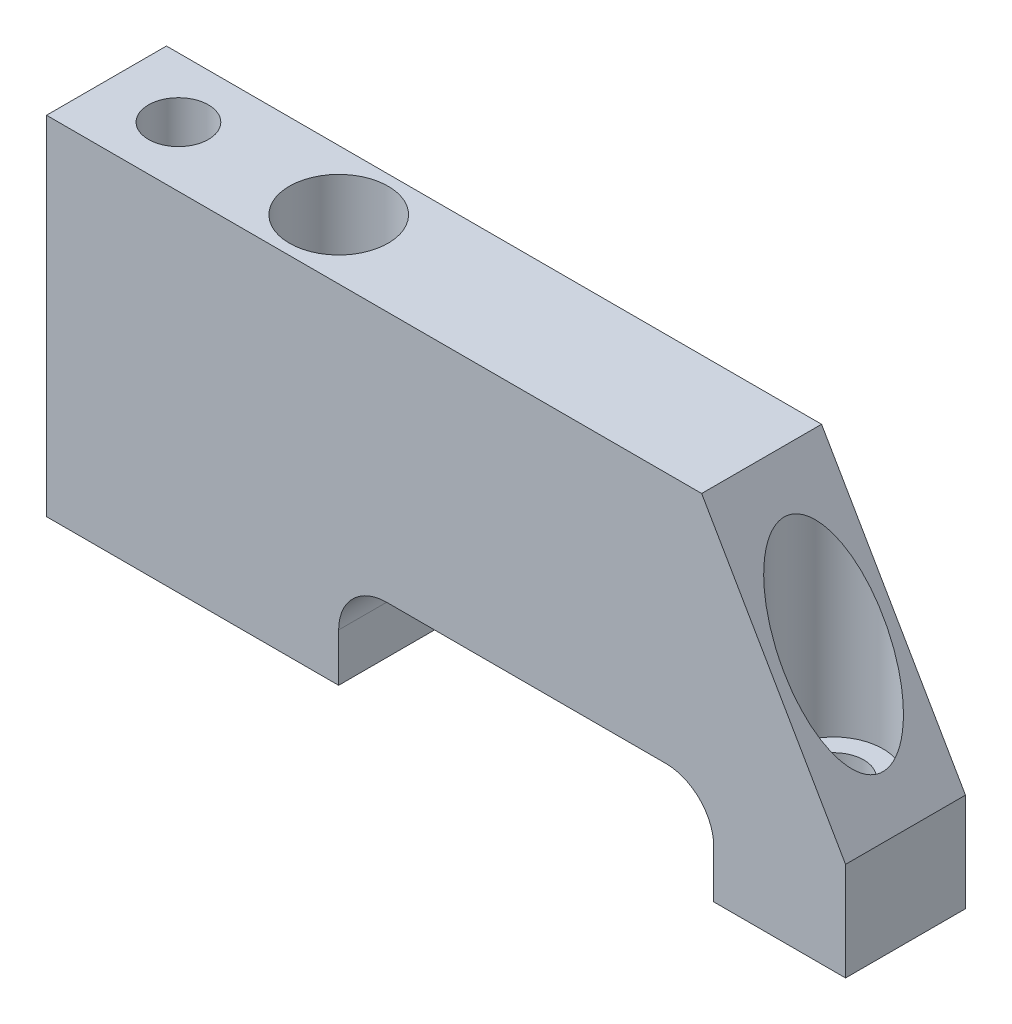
ISO-10303-21;
HEADER;
FILE_DESCRIPTION(('STEP AP214'),'2;1');
FILE_NAME('part.step','',(''),(''),'','','');
FILE_SCHEMA(('AUTOMOTIVE_DESIGN { 1 0 10303 214 1 1 1 1 }'));
ENDSEC;
DATA;
#1=APPLICATION_CONTEXT('core data for automotive mechanical design processes');
#2=APPLICATION_PROTOCOL_DEFINITION('international standard','automotive_design',2000,#1);
#3=PRODUCT_CONTEXT('',#1,'mechanical');
#4=PRODUCT('Part','Part','',(#3));
#5=PRODUCT_RELATED_PRODUCT_CATEGORY('part','',(#4));
#6=PRODUCT_DEFINITION_FORMATION('','',#4);
#7=PRODUCT_DEFINITION_CONTEXT('part definition',#1,'design');
#8=PRODUCT_DEFINITION('design','',#6,#7);
#9=PRODUCT_DEFINITION_SHAPE('','',#8);
#10=(LENGTH_UNIT() NAMED_UNIT(*) SI_UNIT(.MILLI.,.METRE.));
#11=(NAMED_UNIT(*) PLANE_ANGLE_UNIT() SI_UNIT($,.RADIAN.));
#12=(NAMED_UNIT(*) SI_UNIT($,.STERADIAN.) SOLID_ANGLE_UNIT());
#13=UNCERTAINTY_MEASURE_WITH_UNIT(LENGTH_MEASURE(1.E-05),#10,'distance_accuracy_value','');
#14=(GEOMETRIC_REPRESENTATION_CONTEXT(3) GLOBAL_UNCERTAINTY_ASSIGNED_CONTEXT((#13)) GLOBAL_UNIT_ASSIGNED_CONTEXT((#10,
#11,#12)) REPRESENTATION_CONTEXT('',''));
#15=CARTESIAN_POINT('',(0.,0.,0.));
#16=DIRECTION('',(0.,0.,1.));
#17=DIRECTION('',(1.,0.,0.));
#18=AXIS2_PLACEMENT_3D('',#15,#16,#17);
#19=CARTESIAN_POINT('',(42.2783,0.,7.9375));
#20=DIRECTION('',(-1.,0.,0.));
#21=DIRECTION('',(0.,0.,1.));
#22=AXIS2_PLACEMENT_3D('',#19,#20,#21);
#23=PLANE('',#22);
#24=DIRECTION('',(0.,0.,-1.));
#25=VECTOR('',#24,1.);
#26=CARTESIAN_POINT('',(42.2783,13.0292321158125,155.477634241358));
#27=LINE('',#26,#25);
#28=CARTESIAN_POINT('',(42.2783,13.0292321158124,7.9375));
#29=VERTEX_POINT('',#28);
#30=CARTESIAN_POINT('',(42.2783,13.0292321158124,-7.9375));
#31=VERTEX_POINT('',#30);
#32=EDGE_CURVE('E70',#29,#31,#27,.T.);
#33=ORIENTED_EDGE('',*,*,#32,.F.);
#34=DIRECTION('',(0.,1.,0.));
#35=VECTOR('',#34,1.);
#36=CARTESIAN_POINT('',(42.2783,0.,7.9375));
#37=LINE('',#36,#35);
#38=CARTESIAN_POINT('',(42.2783,0.,7.9375));
#39=VERTEX_POINT('',#38);
#40=EDGE_CURVE('E201',#39,#29,#37,.T.);
#41=ORIENTED_EDGE('',*,*,#40,.F.);
#42=DIRECTION('',(0.,0.,-1.));
#43=VECTOR('',#42,1.);
#44=CARTESIAN_POINT('',(42.2783,0.,7.9375));
#45=LINE('',#44,#43);
#46=CARTESIAN_POINT('',(42.2783,0.,-7.9375));
#47=VERTEX_POINT('',#46);
#48=EDGE_CURVE('E220',#39,#47,#45,.T.);
#49=ORIENTED_EDGE('',*,*,#48,.T.);
#50=DIRECTION('',(0.,1.,0.));
#51=VECTOR('',#50,1.);
#52=CARTESIAN_POINT('',(42.2783,0.,-7.9375));
#53=LINE('',#52,#51);
#54=EDGE_CURVE('E146',#47,#31,#53,.T.);
#55=ORIENTED_EDGE('',*,*,#54,.T.);
#56=EDGE_LOOP('',(#33,#41,#49,#55));
#57=FACE_BOUND('',#56,.T.);
#58=ADVANCED_FACE('F47',(#57),#23,.F.);
#59=CARTESIAN_POINT('',(42.2783,46.0248,7.9375));
#60=DIRECTION('',(0.,-1.,0.));
#61=DIRECTION('',(1.,0.,0.));
#62=AXIS2_PLACEMENT_3D('',#59,#60,#61);
#63=PLANE('',#62);
#64=CARTESIAN_POINT('',(-32.7533,46.0248,0.));
#65=DIRECTION('',(0.,1.,0.));
#66=DIRECTION('',(0.,0.,1.));
#67=AXIS2_PLACEMENT_3D('',#64,#65,#66);
#68=CIRCLE('',#67,6.5405);
#69=CARTESIAN_POINT('',(-32.7533,46.0248,6.5405));
#70=VERTEX_POINT('',#69);
#71=EDGE_CURVE('E175',#70,#70,#68,.T.);
#72=ORIENTED_EDGE('',*,*,#71,.F.);
#73=EDGE_LOOP('',(#72));
#74=FACE_BOUND('',#73,.T.);
#75=CARTESIAN_POINT('',(-53.975,46.0248,0.));
#76=DIRECTION('',(0.,1.,0.));
#77=DIRECTION('',(0.,0.,1.));
#78=AXIS2_PLACEMENT_3D('',#75,#76,#77);
#79=CIRCLE('',#78,3.96874999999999);
#80=CARTESIAN_POINT('',(-53.975,46.0248,3.96874999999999));
#81=VERTEX_POINT('',#80);
#82=EDGE_CURVE('E157',#81,#81,#79,.T.);
#83=ORIENTED_EDGE('',*,*,#82,.F.);
#84=EDGE_LOOP('',(#83));
#85=FACE_BOUND('',#84,.T.);
#86=DIRECTION('',(0.,0.,-1.));
#87=VECTOR('',#86,1.);
#88=CARTESIAN_POINT('',(23.2283,46.0248,155.477634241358));
#89=LINE('',#88,#87);
#90=CARTESIAN_POINT('',(23.2283,46.0248,7.9375));
#91=VERTEX_POINT('',#90);
#92=CARTESIAN_POINT('',(23.2283,46.0248,-7.93749999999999));
#93=VERTEX_POINT('',#92);
#94=EDGE_CURVE('E149',#91,#93,#89,.T.);
#95=ORIENTED_EDGE('',*,*,#94,.T.);
#96=DIRECTION('',(-1.,0.,0.));
#97=VECTOR('',#96,1.);
#98=CARTESIAN_POINT('',(42.2783,46.0248,-7.9375));
#99=LINE('',#98,#97);
#100=CARTESIAN_POINT('',(-63.5,46.0248,-7.9375));
#101=VERTEX_POINT('',#100);
#102=EDGE_CURVE('E134',#93,#101,#99,.T.);
#103=ORIENTED_EDGE('',*,*,#102,.T.);
#104=DIRECTION('',(0.,0.,-1.));
#105=VECTOR('',#104,1.);
#106=CARTESIAN_POINT('',(-63.5,46.0248,7.9375));
#107=LINE('',#106,#105);
#108=CARTESIAN_POINT('',(-63.5,46.0248,7.9375));
#109=VERTEX_POINT('',#108);
#110=EDGE_CURVE('E204',#109,#101,#107,.T.);
#111=ORIENTED_EDGE('',*,*,#110,.F.);
#112=DIRECTION('',(-1.,0.,0.));
#113=VECTOR('',#112,1.);
#114=CARTESIAN_POINT('',(42.2783,46.0248,7.9375));
#115=LINE('',#114,#113);
#116=EDGE_CURVE('E151',#91,#109,#115,.T.);
#117=ORIENTED_EDGE('',*,*,#116,.F.);
#118=EDGE_LOOP('',(#95,#103,#111,#117));
#119=FACE_BOUND('',#118,.T.);
#120=ADVANCED_FACE('F150',(#74,#85,#119),#63,.F.);
#121=CARTESIAN_POINT('',(0.,0.,7.9375));
#122=DIRECTION('',(0.,0.,1.));
#123=DIRECTION('',(1.,0.,0.));
#124=AXIS2_PLACEMENT_3D('',#121,#122,#123);
#125=PLANE('',#124);
#126=ORIENTED_EDGE('',*,*,#40,.T.);
#127=DIRECTION('',(-0.499999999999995,0.866025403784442,0.));
#128=VECTOR('',#127,1.);
#129=CARTESIAN_POINT('',(37.350548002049,21.5643489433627,7.9375));
#130=LINE('',#129,#128);
#131=EDGE_CURVE('E62',#29,#91,#130,.T.);
#132=ORIENTED_EDGE('',*,*,#131,.T.);
#133=ORIENTED_EDGE('',*,*,#116,.T.);
#134=DIRECTION('',(0.,-1.,0.));
#135=VECTOR('',#134,1.);
#136=CARTESIAN_POINT('',(-63.5,46.0248,7.9375));
#137=LINE('',#136,#135);
#138=CARTESIAN_POINT('',(-63.5,0.,7.9375));
#139=VERTEX_POINT('',#138);
#140=EDGE_CURVE('E145',#109,#139,#137,.T.);
#141=ORIENTED_EDGE('',*,*,#140,.T.);
#142=DIRECTION('',(1.,0.,0.));
#143=VECTOR('',#142,1.);
#144=CARTESIAN_POINT('',(-63.5,0.,7.9375));
#145=LINE('',#144,#143);
#146=CARTESIAN_POINT('',(-24.8285,0.,7.9375));
#147=VERTEX_POINT('',#146);
#148=EDGE_CURVE('E189',#139,#147,#145,.T.);
#149=ORIENTED_EDGE('',*,*,#148,.T.);
#150=DIRECTION('',(0.,1.,0.));
#151=VECTOR('',#150,1.);
#152=CARTESIAN_POINT('',(-24.8285,0.,7.9375));
#153=LINE('',#152,#151);
#154=CARTESIAN_POINT('',(-24.8285,6.35,7.9375));
#155=VERTEX_POINT('',#154);
#156=EDGE_CURVE('E191',#147,#155,#153,.T.);
#157=ORIENTED_EDGE('',*,*,#156,.T.);
#158=CARTESIAN_POINT('',(-18.4785,6.35,7.9375));
#159=DIRECTION('',(0.,0.,1.));
#160=DIRECTION('',(1.,0.,0.));
#161=AXIS2_PLACEMENT_3D('',#158,#159,#160);
#162=CIRCLE('',#161,6.35);
#163=CARTESIAN_POINT('',(-18.4785,12.7,7.9375));
#164=VERTEX_POINT('',#163);
#165=EDGE_CURVE('E55',#155,#164,#162,.F.);
#166=ORIENTED_EDGE('',*,*,#165,.T.);
#167=DIRECTION('',(1.,0.,0.));
#168=VECTOR('',#167,1.);
#169=CARTESIAN_POINT('',(-24.8285,12.7,7.9375));
#170=LINE('',#169,#168);
#171=CARTESIAN_POINT('',(18.4785,12.7,7.9375));
#172=VERTEX_POINT('',#171);
#173=EDGE_CURVE('E194',#164,#172,#170,.T.);
#174=ORIENTED_EDGE('',*,*,#173,.T.);
#175=CARTESIAN_POINT('',(18.4785,6.35,7.9375));
#176=DIRECTION('',(0.,0.,1.));
#177=DIRECTION('',(1.,0.,0.));
#178=AXIS2_PLACEMENT_3D('',#175,#176,#177);
#179=CIRCLE('',#178,6.35);
#180=CARTESIAN_POINT('',(24.8285,6.35,7.9375));
#181=VERTEX_POINT('',#180);
#182=EDGE_CURVE('E244',#172,#181,#179,.F.);
#183=ORIENTED_EDGE('',*,*,#182,.T.);
#184=DIRECTION('',(0.,-1.,0.));
#185=VECTOR('',#184,1.);
#186=CARTESIAN_POINT('',(24.8285,12.7,7.9375));
#187=LINE('',#186,#185);
#188=CARTESIAN_POINT('',(24.8285,0.,7.9375));
#189=VERTEX_POINT('',#188);
#190=EDGE_CURVE('E197',#181,#189,#187,.T.);
#191=ORIENTED_EDGE('',*,*,#190,.T.);
#192=DIRECTION('',(1.,0.,0.));
#193=VECTOR('',#192,1.);
#194=CARTESIAN_POINT('',(24.8285,0.,7.9375));
#195=LINE('',#194,#193);
#196=EDGE_CURVE('E199',#189,#39,#195,.T.);
#197=ORIENTED_EDGE('',*,*,#196,.T.);
#198=EDGE_LOOP('',(#126,#132,#133,#141,#149,#157,#166,#174,#183,#191,#197));
#199=FACE_BOUND('',#198,.T.);
#200=ADVANCED_FACE('F249',(#199),#125,.T.);
#201=CARTESIAN_POINT('',(0.,0.,-7.9375));
#202=DIRECTION('',(0.,0.,1.));
#203=DIRECTION('',(1.,0.,0.));
#204=AXIS2_PLACEMENT_3D('',#201,#202,#203);
#205=PLANE('',#204);
#206=DIRECTION('',(-0.499999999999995,0.866025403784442,0.));
#207=VECTOR('',#206,1.);
#208=CARTESIAN_POINT('',(37.350548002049,21.5643489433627,-7.9375));
#209=LINE('',#208,#207);
#210=EDGE_CURVE('E139',#31,#93,#209,.T.);
#211=ORIENTED_EDGE('',*,*,#210,.F.);
#212=ORIENTED_EDGE('',*,*,#54,.F.);
#213=DIRECTION('',(1.,0.,0.));
#214=VECTOR('',#213,1.);
#215=CARTESIAN_POINT('',(24.8285,0.,-7.9375));
#216=LINE('',#215,#214);
#217=CARTESIAN_POINT('',(24.8285,0.,-7.9375));
#218=VERTEX_POINT('',#217);
#219=EDGE_CURVE('E216',#218,#47,#216,.T.);
#220=ORIENTED_EDGE('',*,*,#219,.F.);
#221=DIRECTION('',(0.,-1.,0.));
#222=VECTOR('',#221,1.);
#223=CARTESIAN_POINT('',(24.8285,12.7,-7.9375));
#224=LINE('',#223,#222);
#225=CARTESIAN_POINT('',(24.8285,6.35,-7.9375));
#226=VERTEX_POINT('',#225);
#227=EDGE_CURVE('E214',#226,#218,#224,.T.);
#228=ORIENTED_EDGE('',*,*,#227,.F.);
#229=CARTESIAN_POINT('',(18.4785,6.35,-7.9375));
#230=DIRECTION('',(0.,0.,1.));
#231=DIRECTION('',(1.,0.,0.));
#232=AXIS2_PLACEMENT_3D('',#229,#230,#231);
#233=CIRCLE('',#232,6.35);
#234=CARTESIAN_POINT('',(18.4785,12.7,-7.9375));
#235=VERTEX_POINT('',#234);
#236=EDGE_CURVE('E242',#226,#235,#233,.T.);
#237=ORIENTED_EDGE('',*,*,#236,.T.);
#238=DIRECTION('',(1.,0.,0.));
#239=VECTOR('',#238,1.);
#240=CARTESIAN_POINT('',(-24.8285,12.7,-7.9375));
#241=LINE('',#240,#239);
#242=CARTESIAN_POINT('',(-18.4785,12.7,-7.9375));
#243=VERTEX_POINT('',#242);
#244=EDGE_CURVE('E211',#243,#235,#241,.T.);
#245=ORIENTED_EDGE('',*,*,#244,.F.);
#246=CARTESIAN_POINT('',(-18.4785,6.35,-7.9375));
#247=DIRECTION('',(0.,0.,1.));
#248=DIRECTION('',(1.,0.,0.));
#249=AXIS2_PLACEMENT_3D('',#246,#247,#248);
#250=CIRCLE('',#249,6.35);
#251=CARTESIAN_POINT('',(-24.8285,6.35,-7.9375));
#252=VERTEX_POINT('',#251);
#253=EDGE_CURVE('E246',#243,#252,#250,.T.);
#254=ORIENTED_EDGE('',*,*,#253,.T.);
#255=DIRECTION('',(0.,1.,0.));
#256=VECTOR('',#255,1.);
#257=CARTESIAN_POINT('',(-24.8285,0.,-7.9375));
#258=LINE('',#257,#256);
#259=CARTESIAN_POINT('',(-24.8285,0.,-7.9375));
#260=VERTEX_POINT('',#259);
#261=EDGE_CURVE('E208',#260,#252,#258,.T.);
#262=ORIENTED_EDGE('',*,*,#261,.F.);
#263=DIRECTION('',(1.,0.,0.));
#264=VECTOR('',#263,1.);
#265=CARTESIAN_POINT('',(-63.5,0.,-7.9375));
#266=LINE('',#265,#264);
#267=CARTESIAN_POINT('',(-63.5,0.,-7.9375));
#268=VERTEX_POINT('',#267);
#269=EDGE_CURVE('E206',#268,#260,#266,.T.);
#270=ORIENTED_EDGE('',*,*,#269,.F.);
#271=DIRECTION('',(0.,-1.,0.));
#272=VECTOR('',#271,1.);
#273=CARTESIAN_POINT('',(-63.5,46.0248,-7.9375));
#274=LINE('',#273,#272);
#275=EDGE_CURVE('E141',#101,#268,#274,.T.);
#276=ORIENTED_EDGE('',*,*,#275,.F.);
#277=ORIENTED_EDGE('',*,*,#102,.F.);
#278=EDGE_LOOP('',(#211,#212,#220,#228,#237,#245,#254,#262,#270,#276,#277));
#279=FACE_BOUND('',#278,.T.);
#280=ADVANCED_FACE('F136',(#279),#205,.F.);
#281=CARTESIAN_POINT('',(32.7533,46.0248,0.));
#282=DIRECTION('',(0.,1.,0.));
#283=DIRECTION('',(0.,0.,1.));
#284=AXIS2_PLACEMENT_3D('',#281,#282,#283);
#285=CYLINDRICAL_SURFACE('',#284,6.54049999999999);
#286=CARTESIAN_POINT('',(32.7533,14.2748,0.));
#287=DIRECTION('',(0.,1.,0.));
#288=DIRECTION('',(0.,0.,1.));
#289=AXIS2_PLACEMENT_3D('',#286,#287,#288);
#290=CIRCLE('',#289,6.54049999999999);
#291=CARTESIAN_POINT('',(32.7533,14.2748,6.54049999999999));
#292=VERTEX_POINT('',#291);
#293=EDGE_CURVE('E166',#292,#292,#290,.T.);
#294=ORIENTED_EDGE('',*,*,#293,.F.);
#295=EDGE_LOOP('',(#294));
#296=FACE_BOUND('',#295,.T.);
#297=CARTESIAN_POINT('',(32.7533,29.5270160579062,0.));
#298=DIRECTION('',(0.866025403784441,0.499999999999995,0.));
#299=DIRECTION('',(-0.499999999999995,0.866025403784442,0.));
#300=AXIS2_PLACEMENT_3D('',#297,#298,#299);
#301=ELLIPSE('',#300,13.0810000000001,6.54049999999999);
#302=CARTESIAN_POINT('',(26.2128,40.8554943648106,0.));
#303=VERTEX_POINT('',#302);
#304=EDGE_CURVE('E13',#303,#303,#301,.F.);
#305=ORIENTED_EDGE('',*,*,#304,.F.);
#306=EDGE_LOOP('',(#305));
#307=FACE_BOUND('',#306,.T.);
#308=ADVANCED_FACE('F270',(#296,#307),#285,.F.);
#309=CARTESIAN_POINT('',(-63.5,46.0248,7.9375));
#310=DIRECTION('',(1.,0.,0.));
#311=DIRECTION('',(0.,1.,0.));
#312=AXIS2_PLACEMENT_3D('',#309,#310,#311);
#313=PLANE('',#312);
#314=ORIENTED_EDGE('',*,*,#275,.T.);
#315=DIRECTION('',(0.,0.,-1.));
#316=VECTOR('',#315,1.);
#317=CARTESIAN_POINT('',(-63.5,0.,7.9375));
#318=LINE('',#317,#316);
#319=EDGE_CURVE('E229',#139,#268,#318,.T.);
#320=ORIENTED_EDGE('',*,*,#319,.F.);
#321=ORIENTED_EDGE('',*,*,#140,.F.);
#322=ORIENTED_EDGE('',*,*,#110,.T.);
#323=EDGE_LOOP('',(#314,#320,#321,#322));
#324=FACE_BOUND('',#323,.T.);
#325=ADVANCED_FACE('F268',(#324),#313,.F.);
#326=CARTESIAN_POINT('',(-63.5,0.,7.9375));
#327=DIRECTION('',(0.,1.,0.));
#328=DIRECTION('',(0.,0.,1.));
#329=AXIS2_PLACEMENT_3D('',#326,#327,#328);
#330=PLANE('',#329);
#331=CARTESIAN_POINT('',(-32.7533,0.,0.));
#332=DIRECTION('',(0.,1.,0.));
#333=DIRECTION('',(0.,0.,1.));
#334=AXIS2_PLACEMENT_3D('',#331,#332,#333);
#335=CIRCLE('',#334,4.00049999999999);
#336=CARTESIAN_POINT('',(-32.7533,0.,4.00049999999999));
#337=VERTEX_POINT('',#336);
#338=EDGE_CURVE('E184',#337,#337,#335,.T.);
#339=ORIENTED_EDGE('',*,*,#338,.T.);
#340=EDGE_LOOP('',(#339));
#341=FACE_BOUND('',#340,.T.);
#342=ORIENTED_EDGE('',*,*,#269,.T.);
#343=DIRECTION('',(0.,0.,-1.));
#344=VECTOR('',#343,1.);
#345=CARTESIAN_POINT('',(-24.8285,0.,7.9375));
#346=LINE('',#345,#344);
#347=EDGE_CURVE('E226',#147,#260,#346,.T.);
#348=ORIENTED_EDGE('',*,*,#347,.F.);
#349=ORIENTED_EDGE('',*,*,#148,.F.);
#350=ORIENTED_EDGE('',*,*,#319,.T.);
#351=EDGE_LOOP('',(#342,#348,#349,#350));
#352=FACE_BOUND('',#351,.T.);
#353=ADVANCED_FACE('F264',(#341,#352),#330,.F.);
#354=CARTESIAN_POINT('',(-24.8285,0.,7.9375));
#355=DIRECTION('',(-1.,0.,0.));
#356=DIRECTION('',(0.,0.,1.));
#357=AXIS2_PLACEMENT_3D('',#354,#355,#356);
#358=PLANE('',#357);
#359=ORIENTED_EDGE('',*,*,#261,.T.);
#360=DIRECTION('',(0.,0.,-1.));
#361=VECTOR('',#360,1.);
#362=CARTESIAN_POINT('',(-24.8285,6.35,7.9375));
#363=LINE('',#362,#361);
#364=EDGE_CURVE('E240',#252,#155,#363,.F.);
#365=ORIENTED_EDGE('',*,*,#364,.T.);
#366=ORIENTED_EDGE('',*,*,#156,.F.);
#367=ORIENTED_EDGE('',*,*,#347,.T.);
#368=EDGE_LOOP('',(#359,#365,#366,#367));
#369=FACE_BOUND('',#368,.T.);
#370=ADVANCED_FACE('F261',(#369),#358,.F.);
#371=CARTESIAN_POINT('',(-24.8285,12.7,7.9375));
#372=DIRECTION('',(0.,1.,0.));
#373=DIRECTION('',(0.,0.,1.));
#374=AXIS2_PLACEMENT_3D('',#371,#372,#373);
#375=PLANE('',#374);
#376=ORIENTED_EDGE('',*,*,#244,.T.);
#377=DIRECTION('',(0.,0.,-1.));
#378=VECTOR('',#377,1.);
#379=CARTESIAN_POINT('',(18.4785,12.7,7.9375));
#380=LINE('',#379,#378);
#381=EDGE_CURVE('E238',#235,#172,#380,.F.);
#382=ORIENTED_EDGE('',*,*,#381,.T.);
#383=ORIENTED_EDGE('',*,*,#173,.F.);
#384=DIRECTION('',(0.,0.,-1.));
#385=VECTOR('',#384,1.);
#386=CARTESIAN_POINT('',(-18.4785,12.7,-7.9375));
#387=LINE('',#386,#385);
#388=EDGE_CURVE('E235',#164,#243,#387,.T.);
#389=ORIENTED_EDGE('',*,*,#388,.T.);
#390=EDGE_LOOP('',(#376,#382,#383,#389));
#391=FACE_BOUND('',#390,.T.);
#392=ADVANCED_FACE('F256',(#391),#375,.F.);
#393=CARTESIAN_POINT('',(24.8285,12.7,7.9375));
#394=DIRECTION('',(1.,0.,0.));
#395=DIRECTION('',(0.,0.,-1.));
#396=AXIS2_PLACEMENT_3D('',#393,#394,#395);
#397=PLANE('',#396);
#398=ORIENTED_EDGE('',*,*,#190,.F.);
#399=DIRECTION('',(0.,0.,-1.));
#400=VECTOR('',#399,1.);
#401=CARTESIAN_POINT('',(24.8285,6.35,-7.9375));
#402=LINE('',#401,#400);
#403=EDGE_CURVE('E232',#181,#226,#402,.T.);
#404=ORIENTED_EDGE('',*,*,#403,.T.);
#405=ORIENTED_EDGE('',*,*,#227,.T.);
#406=DIRECTION('',(0.,0.,-1.));
#407=VECTOR('',#406,1.);
#408=CARTESIAN_POINT('',(24.8285,0.,7.9375));
#409=LINE('',#408,#407);
#410=EDGE_CURVE('E223',#189,#218,#409,.T.);
#411=ORIENTED_EDGE('',*,*,#410,.F.);
#412=EDGE_LOOP('',(#398,#404,#405,#411));
#413=FACE_BOUND('',#412,.T.);
#414=ADVANCED_FACE('F293',(#413),#397,.F.);
#415=CARTESIAN_POINT('',(24.8285,0.,7.9375));
#416=DIRECTION('',(0.,1.,0.));
#417=DIRECTION('',(-1.,0.,0.));
#418=AXIS2_PLACEMENT_3D('',#415,#416,#417);
#419=PLANE('',#418);
#420=CARTESIAN_POINT('',(32.7533,0.,0.));
#421=DIRECTION('',(0.,1.,0.));
#422=DIRECTION('',(0.,0.,1.));
#423=AXIS2_PLACEMENT_3D('',#420,#421,#422);
#424=CIRCLE('',#423,4.00049999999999);
#425=CARTESIAN_POINT('',(32.7533,0.,4.00049999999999));
#426=VERTEX_POINT('',#425);
#427=EDGE_CURVE('E172',#426,#426,#424,.T.);
#428=ORIENTED_EDGE('',*,*,#427,.T.);
#429=EDGE_LOOP('',(#428));
#430=FACE_BOUND('',#429,.T.);
#431=ORIENTED_EDGE('',*,*,#219,.T.);
#432=ORIENTED_EDGE('',*,*,#48,.F.);
#433=ORIENTED_EDGE('',*,*,#196,.F.);
#434=ORIENTED_EDGE('',*,*,#410,.T.);
#435=EDGE_LOOP('',(#431,#432,#433,#434));
#436=FACE_BOUND('',#435,.T.);
#437=ADVANCED_FACE('F289',(#430,#436),#419,.F.);
#438=CARTESIAN_POINT('',(18.4785,6.35,7.9375));
#439=DIRECTION('',(0.,0.,1.));
#440=DIRECTION('',(1.,0.,0.));
#441=AXIS2_PLACEMENT_3D('',#438,#439,#440);
#442=CYLINDRICAL_SURFACE('',#441,6.35);
#443=ORIENTED_EDGE('',*,*,#182,.F.);
#444=ORIENTED_EDGE('',*,*,#381,.F.);
#445=ORIENTED_EDGE('',*,*,#236,.F.);
#446=ORIENTED_EDGE('',*,*,#403,.F.);
#447=EDGE_LOOP('',(#443,#444,#445,#446));
#448=FACE_BOUND('',#447,.T.);
#449=ADVANCED_FACE('F292',(#448),#442,.F.);
#450=CARTESIAN_POINT('',(-18.4785,6.35,7.9375));
#451=DIRECTION('',(0.,0.,1.));
#452=DIRECTION('',(1.,0.,0.));
#453=AXIS2_PLACEMENT_3D('',#450,#451,#452);
#454=CYLINDRICAL_SURFACE('',#453,6.35);
#455=ORIENTED_EDGE('',*,*,#165,.F.);
#456=ORIENTED_EDGE('',*,*,#364,.F.);
#457=ORIENTED_EDGE('',*,*,#253,.F.);
#458=ORIENTED_EDGE('',*,*,#388,.F.);
#459=EDGE_LOOP('',(#455,#456,#457,#458));
#460=FACE_BOUND('',#459,.T.);
#461=ADVANCED_FACE('F49',(#460),#454,.F.);
#462=CARTESIAN_POINT('',(-32.7533,46.0248,0.));
#463=DIRECTION('',(0.,1.,0.));
#464=DIRECTION('',(0.,0.,1.));
#465=AXIS2_PLACEMENT_3D('',#462,#463,#464);
#466=CYLINDRICAL_SURFACE('',#465,4.00049999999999);
#467=ORIENTED_EDGE('',*,*,#338,.F.);
#468=EDGE_LOOP('',(#467));
#469=FACE_BOUND('',#468,.T.);
#470=CARTESIAN_POINT('',(-32.7533,14.2748,0.));
#471=DIRECTION('',(0.,1.,0.));
#472=DIRECTION('',(0.,0.,1.));
#473=AXIS2_PLACEMENT_3D('',#470,#471,#472);
#474=CIRCLE('',#473,4.00049999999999);
#475=CARTESIAN_POINT('',(-32.7533,14.2748,4.00049999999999));
#476=VERTEX_POINT('',#475);
#477=EDGE_CURVE('E181',#476,#476,#474,.T.);
#478=ORIENTED_EDGE('',*,*,#477,.T.);
#479=EDGE_LOOP('',(#478));
#480=FACE_BOUND('',#479,.T.);
#481=ADVANCED_FACE('F330',(#469,#480),#466,.F.);
#482=CARTESIAN_POINT('',(-28.7528,14.2748,0.));
#483=DIRECTION('',(0.,-1.,0.));
#484=DIRECTION('',(0.,0.,-1.));
#485=AXIS2_PLACEMENT_3D('',#482,#483,#484);
#486=PLANE('',#485);
#487=ORIENTED_EDGE('',*,*,#477,.F.);
#488=EDGE_LOOP('',(#487));
#489=FACE_BOUND('',#488,.T.);
#490=CARTESIAN_POINT('',(-32.7533,14.2748,0.));
#491=DIRECTION('',(0.,1.,0.));
#492=DIRECTION('',(0.,0.,1.));
#493=AXIS2_PLACEMENT_3D('',#490,#491,#492);
#494=CIRCLE('',#493,6.54049999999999);
#495=CARTESIAN_POINT('',(-32.7533,14.2748,6.54049999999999));
#496=VERTEX_POINT('',#495);
#497=EDGE_CURVE('E178',#496,#496,#494,.T.);
#498=ORIENTED_EDGE('',*,*,#497,.T.);
#499=EDGE_LOOP('',(#498));
#500=FACE_BOUND('',#499,.T.);
#501=ADVANCED_FACE('F335',(#489,#500),#486,.F.);
#502=CARTESIAN_POINT('',(-32.7533,46.0248,0.));
#503=DIRECTION('',(0.,1.,0.));
#504=DIRECTION('',(0.,0.,1.));
#505=AXIS2_PLACEMENT_3D('',#502,#503,#504);
#506=CYLINDRICAL_SURFACE('',#505,6.54049999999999);
#507=ORIENTED_EDGE('',*,*,#497,.F.);
#508=EDGE_LOOP('',(#507));
#509=FACE_BOUND('',#508,.T.);
#510=ORIENTED_EDGE('',*,*,#71,.T.);
#511=EDGE_LOOP('',(#510));
#512=FACE_BOUND('',#511,.T.);
#513=ADVANCED_FACE('F343',(#509,#512),#506,.F.);
#514=CARTESIAN_POINT('',(32.7533,46.0248,0.));
#515=DIRECTION('',(0.,1.,0.));
#516=DIRECTION('',(0.,0.,1.));
#517=AXIS2_PLACEMENT_3D('',#514,#515,#516);
#518=CYLINDRICAL_SURFACE('',#517,4.00049999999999);
#519=ORIENTED_EDGE('',*,*,#427,.F.);
#520=EDGE_LOOP('',(#519));
#521=FACE_BOUND('',#520,.T.);
#522=CARTESIAN_POINT('',(32.7533,14.2748,0.));
#523=DIRECTION('',(0.,1.,0.));
#524=DIRECTION('',(0.,0.,1.));
#525=AXIS2_PLACEMENT_3D('',#522,#523,#524);
#526=CIRCLE('',#525,4.0005);
#527=CARTESIAN_POINT('',(32.7533,14.2748,4.0005));
#528=VERTEX_POINT('',#527);
#529=EDGE_CURVE('E169',#528,#528,#526,.T.);
#530=ORIENTED_EDGE('',*,*,#529,.T.);
#531=EDGE_LOOP('',(#530));
#532=FACE_BOUND('',#531,.T.);
#533=ADVANCED_FACE('F351',(#521,#532),#518,.F.);
#534=CARTESIAN_POINT('',(36.7538,14.2748,0.));
#535=DIRECTION('',(0.,-1.,0.));
#536=DIRECTION('',(0.,0.,-1.));
#537=AXIS2_PLACEMENT_3D('',#534,#535,#536);
#538=PLANE('',#537);
#539=ORIENTED_EDGE('',*,*,#529,.F.);
#540=EDGE_LOOP('',(#539));
#541=FACE_BOUND('',#540,.T.);
#542=ORIENTED_EDGE('',*,*,#293,.T.);
#543=EDGE_LOOP('',(#542));
#544=FACE_BOUND('',#543,.T.);
#545=ADVANCED_FACE('F359',(#541,#544),#538,.F.);
#546=CARTESIAN_POINT('',(-53.975,25.7048,0.));
#547=DIRECTION('',(0.,1.,0.));
#548=DIRECTION('',(0.,0.,1.));
#549=AXIS2_PLACEMENT_3D('',#546,#547,#548);
#550=CONICAL_SURFACE('',#549,3.96875,1.02974425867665);
#551=CARTESIAN_POINT('',(-53.975,23.3201344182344,0.));
#552=VERTEX_POINT('',#551);
#553=VERTEX_LOOP('',#552);
#554=FACE_BOUND('',#553,.T.);
#555=CARTESIAN_POINT('',(-53.975,25.7048,0.));
#556=DIRECTION('',(0.,1.,0.));
#557=DIRECTION('',(0.,0.,1.));
#558=AXIS2_PLACEMENT_3D('',#555,#556,#557);
#559=CIRCLE('',#558,3.96875);
#560=CARTESIAN_POINT('',(-53.975,25.7048,3.96875));
#561=VERTEX_POINT('',#560);
#562=EDGE_CURVE('E163',#561,#561,#559,.T.);
#563=ORIENTED_EDGE('',*,*,#562,.T.);
#564=EDGE_LOOP('',(#563));
#565=FACE_BOUND('',#564,.T.);
#566=ADVANCED_FACE('F367',(#554,#565),#550,.F.);
#567=CARTESIAN_POINT('',(-53.975,46.0248,0.));
#568=DIRECTION('',(0.,1.,0.));
#569=DIRECTION('',(0.,0.,1.));
#570=AXIS2_PLACEMENT_3D('',#567,#568,#569);
#571=CYLINDRICAL_SURFACE('',#570,3.96874999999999);
#572=ORIENTED_EDGE('',*,*,#562,.F.);
#573=EDGE_LOOP('',(#572));
#574=FACE_BOUND('',#573,.T.);
#575=ORIENTED_EDGE('',*,*,#82,.T.);
#576=EDGE_LOOP('',(#575));
#577=FACE_BOUND('',#576,.T.);
#578=ADVANCED_FACE('F375',(#574,#577),#571,.F.);
#579=CARTESIAN_POINT('',(23.2283,46.0248,155.477634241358));
#580=DIRECTION('',(0.866025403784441,0.499999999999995,0.));
#581=DIRECTION('',(-0.499999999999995,0.866025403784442,0.));
#582=AXIS2_PLACEMENT_3D('',#579,#580,#581);
#583=PLANE('',#582);
#584=ORIENTED_EDGE('',*,*,#131,.F.);
#585=ORIENTED_EDGE('',*,*,#32,.T.);
#586=ORIENTED_EDGE('',*,*,#210,.T.);
#587=ORIENTED_EDGE('',*,*,#94,.F.);
#588=EDGE_LOOP('',(#584,#585,#586,#587));
#589=FACE_BOUND('',#588,.T.);
#590=ORIENTED_EDGE('',*,*,#304,.T.);
#591=EDGE_LOOP('',(#590));
#592=FACE_BOUND('',#591,.T.);
#593=ADVANCED_FACE('F154',(#589,#592),#583,.T.);
#594=CLOSED_SHELL('',(#58,#120,#200,#280,#308,#325,#353,#370,#392,#414,#437,#449,#461,#481,#501,
#513,#533,#545,#566,#578,#593));
#595=MANIFOLD_SOLID_BREP('B2',#594);
#596=ADVANCED_BREP_SHAPE_REPRESENTATION('',(#18,#595),#14);
#597=SHAPE_DEFINITION_REPRESENTATION(#9,#596);
ENDSEC;
END-ISO-10303-21;
